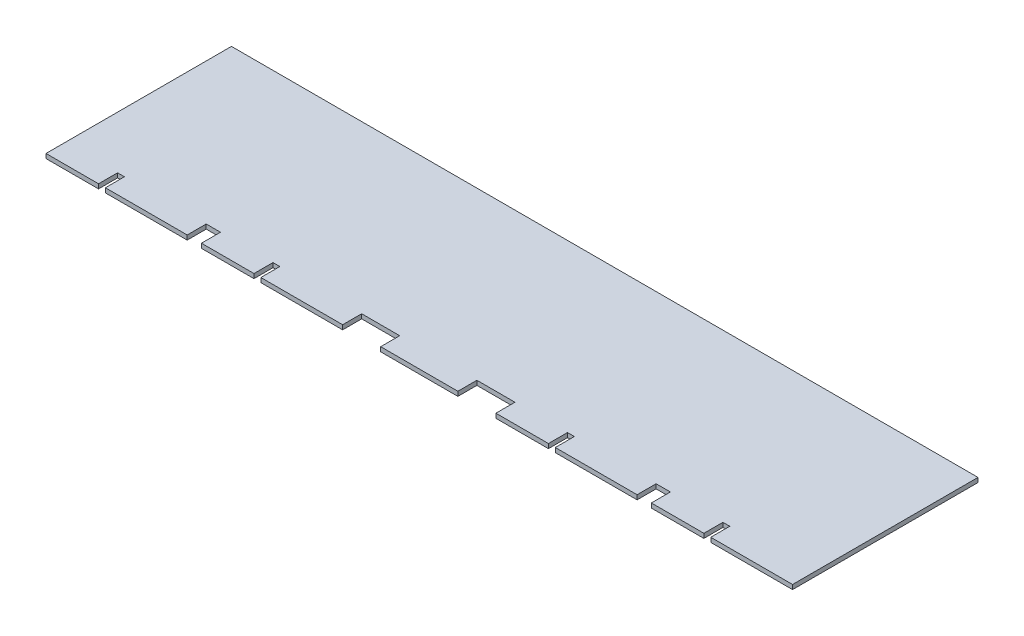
ISO-10303-21;
HEADER;
FILE_DESCRIPTION(('STEP AP214'),'2;1');
FILE_NAME('part.step','',(''),(''),'','','');
FILE_SCHEMA(('AUTOMOTIVE_DESIGN { 1 0 10303 214 1 1 1 1 }'));
ENDSEC;
DATA;
#1=APPLICATION_CONTEXT('core data for automotive mechanical design processes');
#2=APPLICATION_PROTOCOL_DEFINITION('international standard','automotive_design',2000,#1);
#3=PRODUCT_CONTEXT('',#1,'mechanical');
#4=PRODUCT('Part','Part','',(#3));
#5=PRODUCT_RELATED_PRODUCT_CATEGORY('part','',(#4));
#6=PRODUCT_DEFINITION_FORMATION('','',#4);
#7=PRODUCT_DEFINITION_CONTEXT('part definition',#1,'design');
#8=PRODUCT_DEFINITION('design','',#6,#7);
#9=PRODUCT_DEFINITION_SHAPE('','',#8);
#10=(LENGTH_UNIT() NAMED_UNIT(*) SI_UNIT(.MILLI.,.METRE.));
#11=(NAMED_UNIT(*) PLANE_ANGLE_UNIT() SI_UNIT($,.RADIAN.));
#12=(NAMED_UNIT(*) SI_UNIT($,.STERADIAN.) SOLID_ANGLE_UNIT());
#13=UNCERTAINTY_MEASURE_WITH_UNIT(LENGTH_MEASURE(1.E-05),#10,'distance_accuracy_value','');
#14=(GEOMETRIC_REPRESENTATION_CONTEXT(3) GLOBAL_UNCERTAINTY_ASSIGNED_CONTEXT((#13)) GLOBAL_UNIT_ASSIGNED_CONTEXT((#10,
#11,#12)) REPRESENTATION_CONTEXT('',''));
#15=CARTESIAN_POINT('',(0.,0.,0.));
#16=DIRECTION('',(0.,0.,1.));
#17=DIRECTION('',(1.,0.,0.));
#18=AXIS2_PLACEMENT_3D('',#15,#16,#17);
#19=CARTESIAN_POINT('',(-207.884528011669,0.775,0.));
#20=DIRECTION('',(0.,0.,-1.));
#21=DIRECTION('',(-1.,0.,0.));
#22=AXIS2_PLACEMENT_3D('',#19,#20,#21);
#23=PLANE('',#22);
#24=DIRECTION('',(1.,0.,0.));
#25=VECTOR('',#24,1.);
#26=CARTESIAN_POINT('',(-207.884528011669,-0.775,0.));
#27=LINE('',#26,#25);
#28=CARTESIAN_POINT('',(-13.3985,-0.775,0.));
#29=VERTEX_POINT('',#28);
#30=CARTESIAN_POINT('',(13.3985,-0.775,0.));
#31=VERTEX_POINT('',#30);
#32=EDGE_CURVE('E297',#29,#31,#27,.T.);
#33=ORIENTED_EDGE('',*,*,#32,.T.);
#34=DIRECTION('',(0.,-1.,0.));
#35=VECTOR('',#34,1.);
#36=CARTESIAN_POINT('',(13.3985,0.775,0.));
#37=LINE('',#36,#35);
#38=CARTESIAN_POINT('',(13.3985,0.775,0.));
#39=VERTEX_POINT('',#38);
#40=EDGE_CURVE('E11',#39,#31,#37,.T.);
#41=ORIENTED_EDGE('',*,*,#40,.F.);
#42=DIRECTION('',(1.,0.,0.));
#43=VECTOR('',#42,1.);
#44=CARTESIAN_POINT('',(-207.884528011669,0.775,0.));
#45=LINE('',#44,#43);
#46=CARTESIAN_POINT('',(-13.3985,0.775,0.));
#47=VERTEX_POINT('',#46);
#48=EDGE_CURVE('E380',#47,#39,#45,.T.);
#49=ORIENTED_EDGE('',*,*,#48,.F.);
#50=DIRECTION('',(0.,-1.,0.));
#51=VECTOR('',#50,1.);
#52=CARTESIAN_POINT('',(-13.3985,0.775,0.));
#53=LINE('',#52,#51);
#54=EDGE_CURVE('E47',#47,#29,#53,.T.);
#55=ORIENTED_EDGE('',*,*,#54,.T.);
#56=EDGE_LOOP('',(#33,#41,#49,#55));
#57=FACE_BOUND('',#56,.T.);
#58=ADVANCED_FACE('F30',(#57),#23,.F.);
#59=CARTESIAN_POINT('',(13.3985,0.775,-32.1945));
#60=DIRECTION('',(-1.,0.,0.));
#61=DIRECTION('',(0.,0.,1.));
#62=AXIS2_PLACEMENT_3D('',#59,#60,#61);
#63=PLANE('',#62);
#64=DIRECTION('',(0.,0.,-1.));
#65=VECTOR('',#64,1.);
#66=CARTESIAN_POINT('',(13.3985,-0.775,-32.1945));
#67=LINE('',#66,#65);
#68=CARTESIAN_POINT('',(13.3985,-0.775,-6.604));
#69=VERTEX_POINT('',#68);
#70=EDGE_CURVE('E299',#31,#69,#67,.T.);
#71=ORIENTED_EDGE('',*,*,#70,.T.);
#72=DIRECTION('',(0.,-1.,0.));
#73=VECTOR('',#72,1.);
#74=CARTESIAN_POINT('',(13.3985,0.775,-6.604));
#75=LINE('',#74,#73);
#76=CARTESIAN_POINT('',(13.3985,0.775,-6.604));
#77=VERTEX_POINT('',#76);
#78=EDGE_CURVE('E39',#77,#69,#75,.T.);
#79=ORIENTED_EDGE('',*,*,#78,.F.);
#80=DIRECTION('',(0.,0.,-1.));
#81=VECTOR('',#80,1.);
#82=CARTESIAN_POINT('',(13.3985,0.775,-32.1945));
#83=LINE('',#82,#81);
#84=EDGE_CURVE('E170',#39,#77,#83,.T.);
#85=ORIENTED_EDGE('',*,*,#84,.F.);
#86=ORIENTED_EDGE('',*,*,#40,.T.);
#87=EDGE_LOOP('',(#71,#79,#85,#86));
#88=FACE_BOUND('',#87,.T.);
#89=ADVANCED_FACE('F32',(#88),#63,.F.);
#90=CARTESIAN_POINT('',(-207.884528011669,0.775,-6.604));
#91=DIRECTION('',(0.,0.,-1.));
#92=DIRECTION('',(-1.,0.,0.));
#93=AXIS2_PLACEMENT_3D('',#90,#91,#92);
#94=PLANE('',#93);
#95=DIRECTION('',(1.,0.,0.));
#96=VECTOR('',#95,1.);
#97=CARTESIAN_POINT('',(-207.884528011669,-0.775,-6.604));
#98=LINE('',#97,#96);
#99=CARTESIAN_POINT('',(26.6065,-0.775,-6.604));
#100=VERTEX_POINT('',#99);
#101=EDGE_CURVE('E303',#69,#100,#98,.T.);
#102=ORIENTED_EDGE('',*,*,#101,.T.);
#103=DIRECTION('',(0.,-1.,0.));
#104=VECTOR('',#103,1.);
#105=CARTESIAN_POINT('',(26.6065,0.775,-6.604));
#106=LINE('',#105,#104);
#107=CARTESIAN_POINT('',(26.6065,0.775,-6.604));
#108=VERTEX_POINT('',#107);
#109=EDGE_CURVE('E454',#108,#100,#106,.T.);
#110=ORIENTED_EDGE('',*,*,#109,.F.);
#111=DIRECTION('',(1.,0.,0.));
#112=VECTOR('',#111,1.);
#113=CARTESIAN_POINT('',(-207.884528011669,0.775,-6.604));
#114=LINE('',#113,#112);
#115=EDGE_CURVE('E461',#77,#108,#114,.T.);
#116=ORIENTED_EDGE('',*,*,#115,.F.);
#117=ORIENTED_EDGE('',*,*,#78,.T.);
#118=EDGE_LOOP('',(#102,#110,#116,#117));
#119=FACE_BOUND('',#118,.T.);
#120=ADVANCED_FACE('F459',(#119),#94,.F.);
#121=CARTESIAN_POINT('',(26.6065,0.775,-32.1945));
#122=DIRECTION('',(-1.,0.,0.));
#123=DIRECTION('',(0.,0.,1.));
#124=AXIS2_PLACEMENT_3D('',#121,#122,#123);
#125=PLANE('',#124);
#126=DIRECTION('',(0.,0.,-1.));
#127=VECTOR('',#126,1.);
#128=CARTESIAN_POINT('',(26.6065,-0.775,-32.1945));
#129=LINE('',#128,#127);
#130=CARTESIAN_POINT('',(26.6065,-0.775,0.));
#131=VERTEX_POINT('',#130);
#132=EDGE_CURVE('E306',#131,#100,#129,.T.);
#133=ORIENTED_EDGE('',*,*,#132,.F.);
#134=DIRECTION('',(0.,-1.,0.));
#135=VECTOR('',#134,1.);
#136=CARTESIAN_POINT('',(26.6065,0.775,0.));
#137=LINE('',#136,#135);
#138=CARTESIAN_POINT('',(26.6065,0.775,0.));
#139=VERTEX_POINT('',#138);
#140=EDGE_CURVE('E452',#139,#131,#137,.T.);
#141=ORIENTED_EDGE('',*,*,#140,.F.);
#142=DIRECTION('',(0.,0.,-1.));
#143=VECTOR('',#142,1.);
#144=CARTESIAN_POINT('',(26.6065,0.775,-32.1945));
#145=LINE('',#144,#143);
#146=EDGE_CURVE('E472',#139,#108,#145,.T.);
#147=ORIENTED_EDGE('',*,*,#146,.T.);
#148=ORIENTED_EDGE('',*,*,#109,.T.);
#149=EDGE_LOOP('',(#133,#141,#147,#148));
#150=FACE_BOUND('',#149,.T.);
#151=ADVANCED_FACE('F468',(#150),#125,.T.);
#152=CARTESIAN_POINT('',(-207.884528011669,0.775,0.));
#153=DIRECTION('',(0.,0.,-1.));
#154=DIRECTION('',(-1.,0.,0.));
#155=AXIS2_PLACEMENT_3D('',#152,#153,#154);
#156=PLANE('',#155);
#157=DIRECTION('',(1.,0.,0.));
#158=VECTOR('',#157,1.);
#159=CARTESIAN_POINT('',(-207.884528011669,-0.775,0.));
#160=LINE('',#159,#158);
#161=CARTESIAN_POINT('',(44.8437,-0.775,0.));
#162=VERTEX_POINT('',#161);
#163=EDGE_CURVE('E309',#131,#162,#160,.T.);
#164=ORIENTED_EDGE('',*,*,#163,.T.);
#165=DIRECTION('',(0.,-1.,0.));
#166=VECTOR('',#165,1.);
#167=CARTESIAN_POINT('',(44.8437,0.775,0.));
#168=LINE('',#167,#166);
#169=CARTESIAN_POINT('',(44.8437,0.775,0.));
#170=VERTEX_POINT('',#169);
#171=EDGE_CURVE('E449',#170,#162,#168,.T.);
#172=ORIENTED_EDGE('',*,*,#171,.F.);
#173=DIRECTION('',(1.,0.,0.));
#174=VECTOR('',#173,1.);
#175=CARTESIAN_POINT('',(-207.884528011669,0.775,0.));
#176=LINE('',#175,#174);
#177=EDGE_CURVE('E473',#139,#170,#176,.T.);
#178=ORIENTED_EDGE('',*,*,#177,.F.);
#179=ORIENTED_EDGE('',*,*,#140,.T.);
#180=EDGE_LOOP('',(#164,#172,#178,#179));
#181=FACE_BOUND('',#180,.T.);
#182=ADVANCED_FACE('F782',(#181),#156,.F.);
#183=CARTESIAN_POINT('',(44.8437,0.775,-32.1945));
#184=DIRECTION('',(-1.,0.,0.));
#185=DIRECTION('',(0.,0.,1.));
#186=AXIS2_PLACEMENT_3D('',#183,#184,#185);
#187=PLANE('',#186);
#188=DIRECTION('',(0.,0.,-1.));
#189=VECTOR('',#188,1.);
#190=CARTESIAN_POINT('',(44.8437,-0.775,-32.1945));
#191=LINE('',#190,#189);
#192=CARTESIAN_POINT('',(44.8437,-0.775,-6.604));
#193=VERTEX_POINT('',#192);
#194=EDGE_CURVE('E311',#162,#193,#191,.T.);
#195=ORIENTED_EDGE('',*,*,#194,.T.);
#196=DIRECTION('',(0.,-1.,0.));
#197=VECTOR('',#196,1.);
#198=CARTESIAN_POINT('',(44.8437,0.775,-6.604));
#199=LINE('',#198,#197);
#200=CARTESIAN_POINT('',(44.8437,0.775,-6.604));
#201=VERTEX_POINT('',#200);
#202=EDGE_CURVE('E446',#201,#193,#199,.T.);
#203=ORIENTED_EDGE('',*,*,#202,.F.);
#204=DIRECTION('',(0.,0.,-1.));
#205=VECTOR('',#204,1.);
#206=CARTESIAN_POINT('',(44.8437,0.775,-32.1945));
#207=LINE('',#206,#205);
#208=EDGE_CURVE('E475',#170,#201,#207,.T.);
#209=ORIENTED_EDGE('',*,*,#208,.F.);
#210=ORIENTED_EDGE('',*,*,#171,.T.);
#211=EDGE_LOOP('',(#195,#203,#209,#210));
#212=FACE_BOUND('',#211,.T.);
#213=ADVANCED_FACE('F868',(#212),#187,.F.);
#214=CARTESIAN_POINT('',(-207.884528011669,0.775,-6.604));
#215=DIRECTION('',(0.,0.,-1.));
#216=DIRECTION('',(-1.,0.,0.));
#217=AXIS2_PLACEMENT_3D('',#214,#215,#216);
#218=PLANE('',#217);
#219=DIRECTION('',(1.,0.,0.));
#220=VECTOR('',#219,1.);
#221=CARTESIAN_POINT('',(-207.884528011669,-0.775,-6.604));
#222=LINE('',#221,#220);
#223=CARTESIAN_POINT('',(47.2313,-0.775,-6.604));
#224=VERTEX_POINT('',#223);
#225=EDGE_CURVE('E315',#193,#224,#222,.T.);
#226=ORIENTED_EDGE('',*,*,#225,.T.);
#227=DIRECTION('',(0.,-1.,0.));
#228=VECTOR('',#227,1.);
#229=CARTESIAN_POINT('',(47.2313,0.775,-6.604));
#230=LINE('',#229,#228);
#231=CARTESIAN_POINT('',(47.2313,0.775,-6.604));
#232=VERTEX_POINT('',#231);
#233=EDGE_CURVE('E444',#232,#224,#230,.T.);
#234=ORIENTED_EDGE('',*,*,#233,.F.);
#235=DIRECTION('',(1.,0.,0.));
#236=VECTOR('',#235,1.);
#237=CARTESIAN_POINT('',(-207.884528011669,0.775,-6.604));
#238=LINE('',#237,#236);
#239=EDGE_CURVE('E483',#201,#232,#238,.T.);
#240=ORIENTED_EDGE('',*,*,#239,.F.);
#241=ORIENTED_EDGE('',*,*,#202,.T.);
#242=EDGE_LOOP('',(#226,#234,#240,#241));
#243=FACE_BOUND('',#242,.T.);
#244=ADVANCED_FACE('F859',(#243),#218,.F.);
#245=CARTESIAN_POINT('',(47.2313,0.775,-32.1945));
#246=DIRECTION('',(-1.,0.,0.));
#247=DIRECTION('',(0.,0.,1.));
#248=AXIS2_PLACEMENT_3D('',#245,#246,#247);
#249=PLANE('',#248);
#250=DIRECTION('',(0.,0.,-1.));
#251=VECTOR('',#250,1.);
#252=CARTESIAN_POINT('',(47.2313,-0.775,-32.1945));
#253=LINE('',#252,#251);
#254=CARTESIAN_POINT('',(47.2313,-0.775,0.));
#255=VERTEX_POINT('',#254);
#256=EDGE_CURVE('E318',#255,#224,#253,.T.);
#257=ORIENTED_EDGE('',*,*,#256,.F.);
#258=DIRECTION('',(0.,-1.,0.));
#259=VECTOR('',#258,1.);
#260=CARTESIAN_POINT('',(47.2313,0.775,0.));
#261=LINE('',#260,#259);
#262=CARTESIAN_POINT('',(47.2313,0.775,0.));
#263=VERTEX_POINT('',#262);
#264=EDGE_CURVE('E442',#263,#255,#261,.T.);
#265=ORIENTED_EDGE('',*,*,#264,.F.);
#266=DIRECTION('',(0.,0.,-1.));
#267=VECTOR('',#266,1.);
#268=CARTESIAN_POINT('',(47.2313,0.775,-32.1945));
#269=LINE('',#268,#267);
#270=EDGE_CURVE('E485',#263,#232,#269,.T.);
#271=ORIENTED_EDGE('',*,*,#270,.T.);
#272=ORIENTED_EDGE('',*,*,#233,.T.);
#273=EDGE_LOOP('',(#257,#265,#271,#272));
#274=FACE_BOUND('',#273,.T.);
#275=ADVANCED_FACE('F851',(#274),#249,.T.);
#276=CARTESIAN_POINT('',(75.6285,-0.775,0.));
#277=VERTEX_POINT('',#276);
#278=EDGE_CURVE('E313',#255,#277,#160,.T.);
#279=ORIENTED_EDGE('',*,*,#278,.T.);
#280=DIRECTION('',(0.,-1.,0.));
#281=VECTOR('',#280,1.);
#282=CARTESIAN_POINT('',(75.6285,0.775,0.));
#283=LINE('',#282,#281);
#284=CARTESIAN_POINT('',(75.6285,0.775,0.));
#285=VERTEX_POINT('',#284);
#286=EDGE_CURVE('E439',#285,#277,#283,.T.);
#287=ORIENTED_EDGE('',*,*,#286,.F.);
#288=EDGE_CURVE('E478',#263,#285,#176,.T.);
#289=ORIENTED_EDGE('',*,*,#288,.F.);
#290=ORIENTED_EDGE('',*,*,#264,.T.);
#291=EDGE_LOOP('',(#279,#287,#289,#290));
#292=FACE_BOUND('',#291,.T.);
#293=ADVANCED_FACE('F818',(#292),#156,.F.);
#294=CARTESIAN_POINT('',(75.6285,0.775,-32.1945));
#295=DIRECTION('',(-1.,0.,0.));
#296=DIRECTION('',(0.,0.,1.));
#297=AXIS2_PLACEMENT_3D('',#294,#295,#296);
#298=PLANE('',#297);
#299=DIRECTION('',(0.,0.,-1.));
#300=VECTOR('',#299,1.);
#301=CARTESIAN_POINT('',(75.6285,-0.775,-32.1945));
#302=LINE('',#301,#300);
#303=CARTESIAN_POINT('',(75.6285,-0.775,-6.604));
#304=VERTEX_POINT('',#303);
#305=EDGE_CURVE('E321',#277,#304,#302,.T.);
#306=ORIENTED_EDGE('',*,*,#305,.T.);
#307=DIRECTION('',(0.,-1.,0.));
#308=VECTOR('',#307,1.);
#309=CARTESIAN_POINT('',(75.6285,0.775,-6.604));
#310=LINE('',#309,#308);
#311=CARTESIAN_POINT('',(75.6285,0.775,-6.604));
#312=VERTEX_POINT('',#311);
#313=EDGE_CURVE('E436',#312,#304,#310,.T.);
#314=ORIENTED_EDGE('',*,*,#313,.F.);
#315=DIRECTION('',(0.,0.,-1.));
#316=VECTOR('',#315,1.);
#317=CARTESIAN_POINT('',(75.6285,0.775,-32.1945));
#318=LINE('',#317,#316);
#319=EDGE_CURVE('E488',#285,#312,#318,.T.);
#320=ORIENTED_EDGE('',*,*,#319,.F.);
#321=ORIENTED_EDGE('',*,*,#286,.T.);
#322=EDGE_LOOP('',(#306,#314,#320,#321));
#323=FACE_BOUND('',#322,.T.);
#324=ADVANCED_FACE('F834',(#323),#298,.F.);
#325=CARTESIAN_POINT('',(-207.884528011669,0.775,-6.604));
#326=DIRECTION('',(0.,0.,-1.));
#327=DIRECTION('',(-1.,0.,0.));
#328=AXIS2_PLACEMENT_3D('',#325,#326,#327);
#329=PLANE('',#328);
#330=DIRECTION('',(1.,0.,0.));
#331=VECTOR('',#330,1.);
#332=CARTESIAN_POINT('',(-207.884528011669,-0.775,-6.604));
#333=LINE('',#332,#331);
#334=CARTESIAN_POINT('',(80.5815000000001,-0.775,-6.604));
#335=VERTEX_POINT('',#334);
#336=EDGE_CURVE('E323',#304,#335,#333,.T.);
#337=ORIENTED_EDGE('',*,*,#336,.T.);
#338=DIRECTION('',(0.,-1.,0.));
#339=VECTOR('',#338,1.);
#340=CARTESIAN_POINT('',(80.5815000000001,0.775,-6.604));
#341=LINE('',#340,#339);
#342=CARTESIAN_POINT('',(80.5815000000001,0.775,-6.604));
#343=VERTEX_POINT('',#342);
#344=EDGE_CURVE('E434',#343,#335,#341,.T.);
#345=ORIENTED_EDGE('',*,*,#344,.F.);
#346=DIRECTION('',(1.,0.,0.));
#347=VECTOR('',#346,1.);
#348=CARTESIAN_POINT('',(-207.884528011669,0.775,-6.604));
#349=LINE('',#348,#347);
#350=EDGE_CURVE('E490',#312,#343,#349,.T.);
#351=ORIENTED_EDGE('',*,*,#350,.F.);
#352=ORIENTED_EDGE('',*,*,#313,.T.);
#353=EDGE_LOOP('',(#337,#345,#351,#352));
#354=FACE_BOUND('',#353,.T.);
#355=ADVANCED_FACE('F825',(#354),#329,.F.);
#356=CARTESIAN_POINT('',(80.5815,0.775,-32.1945));
#357=DIRECTION('',(-1.,0.,0.));
#358=DIRECTION('',(0.,0.,1.));
#359=AXIS2_PLACEMENT_3D('',#356,#357,#358);
#360=PLANE('',#359);
#361=DIRECTION('',(0.,0.,-1.));
#362=VECTOR('',#361,1.);
#363=CARTESIAN_POINT('',(80.5815,-0.775,-32.1945));
#364=LINE('',#363,#362);
#365=CARTESIAN_POINT('',(80.5815000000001,-0.775,0.));
#366=VERTEX_POINT('',#365);
#367=EDGE_CURVE('E326',#366,#335,#364,.T.);
#368=ORIENTED_EDGE('',*,*,#367,.F.);
#369=DIRECTION('',(0.,-1.,0.));
#370=VECTOR('',#369,1.);
#371=CARTESIAN_POINT('',(80.5815000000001,0.775,0.));
#372=LINE('',#371,#370);
#373=CARTESIAN_POINT('',(80.5815000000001,0.775,0.));
#374=VERTEX_POINT('',#373);
#375=EDGE_CURVE('E432',#374,#366,#372,.T.);
#376=ORIENTED_EDGE('',*,*,#375,.F.);
#377=DIRECTION('',(0.,0.,-1.));
#378=VECTOR('',#377,1.);
#379=CARTESIAN_POINT('',(80.5815,0.775,-32.1945));
#380=LINE('',#379,#378);
#381=EDGE_CURVE('E492',#374,#343,#380,.T.);
#382=ORIENTED_EDGE('',*,*,#381,.T.);
#383=ORIENTED_EDGE('',*,*,#344,.T.);
#384=EDGE_LOOP('',(#368,#376,#382,#383));
#385=FACE_BOUND('',#384,.T.);
#386=ADVANCED_FACE('F816',(#385),#360,.T.);
#387=CARTESIAN_POINT('',(98.8187,-0.775,0.));
#388=VERTEX_POINT('',#387);
#389=EDGE_CURVE('E329',#366,#388,#160,.T.);
#390=ORIENTED_EDGE('',*,*,#389,.T.);
#391=DIRECTION('',(0.,-1.,0.));
#392=VECTOR('',#391,1.);
#393=CARTESIAN_POINT('',(98.8187,0.775,0.));
#394=LINE('',#393,#392);
#395=CARTESIAN_POINT('',(98.8187,0.775,0.));
#396=VERTEX_POINT('',#395);
#397=EDGE_CURVE('E429',#396,#388,#394,.T.);
#398=ORIENTED_EDGE('',*,*,#397,.F.);
#399=EDGE_CURVE('E495',#374,#396,#176,.T.);
#400=ORIENTED_EDGE('',*,*,#399,.F.);
#401=ORIENTED_EDGE('',*,*,#375,.T.);
#402=EDGE_LOOP('',(#390,#398,#400,#401));
#403=FACE_BOUND('',#402,.T.);
#404=ADVANCED_FACE('F783',(#403),#156,.F.);
#405=CARTESIAN_POINT('',(98.8187,0.775,-32.1945));
#406=DIRECTION('',(-1.,0.,0.));
#407=DIRECTION('',(0.,0.,1.));
#408=AXIS2_PLACEMENT_3D('',#405,#406,#407);
#409=PLANE('',#408);
#410=DIRECTION('',(0.,0.,-1.));
#411=VECTOR('',#410,1.);
#412=CARTESIAN_POINT('',(98.8187,-0.775,-32.1945));
#413=LINE('',#412,#411);
#414=CARTESIAN_POINT('',(98.8187,-0.775,-6.604));
#415=VERTEX_POINT('',#414);
#416=EDGE_CURVE('E330',#388,#415,#413,.T.);
#417=ORIENTED_EDGE('',*,*,#416,.T.);
#418=DIRECTION('',(0.,-1.,0.));
#419=VECTOR('',#418,1.);
#420=CARTESIAN_POINT('',(98.8187,0.775,-6.604));
#421=LINE('',#420,#419);
#422=CARTESIAN_POINT('',(98.8187,0.775,-6.604));
#423=VERTEX_POINT('',#422);
#424=EDGE_CURVE('E426',#423,#415,#421,.T.);
#425=ORIENTED_EDGE('',*,*,#424,.F.);
#426=DIRECTION('',(0.,0.,-1.));
#427=VECTOR('',#426,1.);
#428=CARTESIAN_POINT('',(98.8187,0.775,-32.1945));
#429=LINE('',#428,#427);
#430=EDGE_CURVE('E496',#396,#423,#429,.T.);
#431=ORIENTED_EDGE('',*,*,#430,.F.);
#432=ORIENTED_EDGE('',*,*,#397,.T.);
#433=EDGE_LOOP('',(#417,#425,#431,#432));
#434=FACE_BOUND('',#433,.T.);
#435=ADVANCED_FACE('F799',(#434),#409,.F.);
#436=CARTESIAN_POINT('',(-207.884528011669,0.775,-6.604));
#437=DIRECTION('',(0.,0.,-1.));
#438=DIRECTION('',(-1.,0.,0.));
#439=AXIS2_PLACEMENT_3D('',#436,#437,#438);
#440=PLANE('',#439);
#441=DIRECTION('',(1.,0.,0.));
#442=VECTOR('',#441,1.);
#443=CARTESIAN_POINT('',(-207.884528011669,-0.775,-6.604));
#444=LINE('',#443,#442);
#445=CARTESIAN_POINT('',(101.2063,-0.775,-6.604));
#446=VERTEX_POINT('',#445);
#447=EDGE_CURVE('E332',#415,#446,#444,.T.);
#448=ORIENTED_EDGE('',*,*,#447,.T.);
#449=DIRECTION('',(0.,-1.,0.));
#450=VECTOR('',#449,1.);
#451=CARTESIAN_POINT('',(101.2063,0.775,-6.604));
#452=LINE('',#451,#450);
#453=CARTESIAN_POINT('',(101.2063,0.775,-6.604));
#454=VERTEX_POINT('',#453);
#455=EDGE_CURVE('E424',#454,#446,#452,.T.);
#456=ORIENTED_EDGE('',*,*,#455,.F.);
#457=DIRECTION('',(1.,0.,0.));
#458=VECTOR('',#457,1.);
#459=CARTESIAN_POINT('',(-207.884528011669,0.775,-6.604));
#460=LINE('',#459,#458);
#461=EDGE_CURVE('E498',#423,#454,#460,.T.);
#462=ORIENTED_EDGE('',*,*,#461,.F.);
#463=ORIENTED_EDGE('',*,*,#424,.T.);
#464=EDGE_LOOP('',(#448,#456,#462,#463));
#465=FACE_BOUND('',#464,.T.);
#466=ADVANCED_FACE('F790',(#465),#440,.F.);
#467=CARTESIAN_POINT('',(101.2063,0.775,-32.1945));
#468=DIRECTION('',(-1.,0.,0.));
#469=DIRECTION('',(0.,0.,1.));
#470=AXIS2_PLACEMENT_3D('',#467,#468,#469);
#471=PLANE('',#470);
#472=DIRECTION('',(0.,0.,-1.));
#473=VECTOR('',#472,1.);
#474=CARTESIAN_POINT('',(101.2063,-0.775,-32.1945));
#475=LINE('',#474,#473);
#476=CARTESIAN_POINT('',(101.2063,-0.775,0.));
#477=VERTEX_POINT('',#476);
#478=EDGE_CURVE('E335',#477,#446,#475,.T.);
#479=ORIENTED_EDGE('',*,*,#478,.F.);
#480=DIRECTION('',(0.,-1.,0.));
#481=VECTOR('',#480,1.);
#482=CARTESIAN_POINT('',(101.2063,0.775,0.));
#483=LINE('',#482,#481);
#484=CARTESIAN_POINT('',(101.2063,0.775,0.));
#485=VERTEX_POINT('',#484);
#486=EDGE_CURVE('E422',#485,#477,#483,.T.);
#487=ORIENTED_EDGE('',*,*,#486,.F.);
#488=DIRECTION('',(0.,0.,-1.));
#489=VECTOR('',#488,1.);
#490=CARTESIAN_POINT('',(101.2063,0.775,-32.1945));
#491=LINE('',#490,#489);
#492=EDGE_CURVE('E500',#485,#454,#491,.T.);
#493=ORIENTED_EDGE('',*,*,#492,.T.);
#494=ORIENTED_EDGE('',*,*,#455,.T.);
#495=EDGE_LOOP('',(#479,#487,#493,#494));
#496=FACE_BOUND('',#495,.T.);
#497=ADVANCED_FACE('F779',(#496),#471,.T.);
#498=CARTESIAN_POINT('',(129.6035,-0.775,0.));
#499=VERTEX_POINT('',#498);
#500=EDGE_CURVE('E312',#477,#499,#160,.T.);
#501=ORIENTED_EDGE('',*,*,#500,.T.);
#502=DIRECTION('',(0.,-1.,0.));
#503=VECTOR('',#502,1.);
#504=CARTESIAN_POINT('',(129.6035,0.775,0.));
#505=LINE('',#504,#503);
#506=CARTESIAN_POINT('',(129.6035,0.775,0.));
#507=VERTEX_POINT('',#506);
#508=EDGE_CURVE('E419',#507,#499,#505,.T.);
#509=ORIENTED_EDGE('',*,*,#508,.F.);
#510=EDGE_CURVE('E477',#485,#507,#176,.T.);
#511=ORIENTED_EDGE('',*,*,#510,.F.);
#512=ORIENTED_EDGE('',*,*,#486,.T.);
#513=EDGE_LOOP('',(#501,#509,#511,#512));
#514=FACE_BOUND('',#513,.T.);
#515=ADVANCED_FACE('F770',(#514),#156,.F.);
#516=CARTESIAN_POINT('',(129.6035,0.775,-32.1945));
#517=DIRECTION('',(-1.,0.,0.));
#518=DIRECTION('',(0.,0.,1.));
#519=AXIS2_PLACEMENT_3D('',#516,#517,#518);
#520=PLANE('',#519);
#521=DIRECTION('',(0.,0.,-1.));
#522=VECTOR('',#521,1.);
#523=CARTESIAN_POINT('',(129.6035,-0.775,-32.1945));
#524=LINE('',#523,#522);
#525=CARTESIAN_POINT('',(129.6035,-0.775,-64.389));
#526=VERTEX_POINT('',#525);
#527=EDGE_CURVE('E338',#499,#526,#524,.T.);
#528=ORIENTED_EDGE('',*,*,#527,.T.);
#529=DIRECTION('',(0.,-1.,0.));
#530=VECTOR('',#529,1.);
#531=CARTESIAN_POINT('',(129.6035,0.775,-64.389));
#532=LINE('',#531,#530);
#533=CARTESIAN_POINT('',(129.6035,0.775,-64.389));
#534=VERTEX_POINT('',#533);
#535=EDGE_CURVE('E417',#534,#526,#532,.T.);
#536=ORIENTED_EDGE('',*,*,#535,.F.);
#537=DIRECTION('',(0.,0.,-1.));
#538=VECTOR('',#537,1.);
#539=CARTESIAN_POINT('',(129.6035,0.775,-32.1945));
#540=LINE('',#539,#538);
#541=EDGE_CURVE('E503',#507,#534,#540,.T.);
#542=ORIENTED_EDGE('',*,*,#541,.F.);
#543=ORIENTED_EDGE('',*,*,#508,.T.);
#544=EDGE_LOOP('',(#528,#536,#542,#543));
#545=FACE_BOUND('',#544,.T.);
#546=ADVANCED_FACE('F761',(#545),#520,.F.);
#547=CARTESIAN_POINT('',(-207.884528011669,0.775,-64.389));
#548=DIRECTION('',(0.,0.,-1.));
#549=DIRECTION('',(-1.,0.,0.));
#550=AXIS2_PLACEMENT_3D('',#547,#548,#549);
#551=PLANE('',#550);
#552=DIRECTION('',(1.,0.,0.));
#553=VECTOR('',#552,1.);
#554=CARTESIAN_POINT('',(-207.884528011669,-0.775,-64.389));
#555=LINE('',#554,#553);
#556=CARTESIAN_POINT('',(-129.6035,-0.775,-64.389));
#557=VERTEX_POINT('',#556);
#558=EDGE_CURVE('E341',#557,#526,#555,.T.);
#559=ORIENTED_EDGE('',*,*,#558,.F.);
#560=DIRECTION('',(0.,-1.,0.));
#561=VECTOR('',#560,1.);
#562=CARTESIAN_POINT('',(-129.6035,0.775,-64.389));
#563=LINE('',#562,#561);
#564=CARTESIAN_POINT('',(-129.6035,0.775,-64.389));
#565=VERTEX_POINT('',#564);
#566=EDGE_CURVE('E415',#565,#557,#563,.T.);
#567=ORIENTED_EDGE('',*,*,#566,.F.);
#568=DIRECTION('',(1.,0.,0.));
#569=VECTOR('',#568,1.);
#570=CARTESIAN_POINT('',(-207.884528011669,0.775,-64.389));
#571=LINE('',#570,#569);
#572=EDGE_CURVE('E505',#565,#534,#571,.T.);
#573=ORIENTED_EDGE('',*,*,#572,.T.);
#574=ORIENTED_EDGE('',*,*,#535,.T.);
#575=EDGE_LOOP('',(#559,#567,#573,#574));
#576=FACE_BOUND('',#575,.T.);
#577=ADVANCED_FACE('F752',(#576),#551,.T.);
#578=CARTESIAN_POINT('',(-129.6035,0.775,-32.1945));
#579=DIRECTION('',(-1.,0.,0.));
#580=DIRECTION('',(0.,0.,1.));
#581=AXIS2_PLACEMENT_3D('',#578,#579,#580);
#582=PLANE('',#581);
#583=DIRECTION('',(0.,0.,-1.));
#584=VECTOR('',#583,1.);
#585=CARTESIAN_POINT('',(-129.6035,-0.775,-32.1945));
#586=LINE('',#585,#584);
#587=CARTESIAN_POINT('',(-129.6035,-0.775,0.));
#588=VERTEX_POINT('',#587);
#589=EDGE_CURVE('E344',#588,#557,#586,.T.);
#590=ORIENTED_EDGE('',*,*,#589,.F.);
#591=DIRECTION('',(0.,-1.,0.));
#592=VECTOR('',#591,1.);
#593=CARTESIAN_POINT('',(-129.6035,0.775,0.));
#594=LINE('',#593,#592);
#595=CARTESIAN_POINT('',(-129.6035,0.775,0.));
#596=VERTEX_POINT('',#595);
#597=EDGE_CURVE('E413',#596,#588,#594,.T.);
#598=ORIENTED_EDGE('',*,*,#597,.F.);
#599=DIRECTION('',(0.,0.,-1.));
#600=VECTOR('',#599,1.);
#601=CARTESIAN_POINT('',(-129.6035,0.775,-32.1945));
#602=LINE('',#601,#600);
#603=EDGE_CURVE('E508',#596,#565,#602,.T.);
#604=ORIENTED_EDGE('',*,*,#603,.T.);
#605=ORIENTED_EDGE('',*,*,#566,.T.);
#606=EDGE_LOOP('',(#590,#598,#604,#605));
#607=FACE_BOUND('',#606,.T.);
#608=ADVANCED_FACE('F612',(#607),#582,.T.);
#609=CARTESIAN_POINT('',(-111.3663,-0.775,0.));
#610=VERTEX_POINT('',#609);
#611=EDGE_CURVE('E301',#588,#610,#27,.T.);
#612=ORIENTED_EDGE('',*,*,#611,.T.);
#613=DIRECTION('',(0.,-1.,0.));
#614=VECTOR('',#613,1.);
#615=CARTESIAN_POINT('',(-111.3663,0.775,0.));
#616=LINE('',#615,#614);
#617=CARTESIAN_POINT('',(-111.3663,0.775,0.));
#618=VERTEX_POINT('',#617);
#619=EDGE_CURVE('E410',#618,#610,#616,.T.);
#620=ORIENTED_EDGE('',*,*,#619,.F.);
#621=EDGE_CURVE('E511',#596,#618,#45,.T.);
#622=ORIENTED_EDGE('',*,*,#621,.F.);
#623=ORIENTED_EDGE('',*,*,#597,.T.);
#624=EDGE_LOOP('',(#612,#620,#622,#623));
#625=FACE_BOUND('',#624,.T.);
#626=ADVANCED_FACE('F580',(#625),#23,.F.);
#627=CARTESIAN_POINT('',(-111.3663,0.775,-32.1945));
#628=DIRECTION('',(-1.,0.,0.));
#629=DIRECTION('',(0.,0.,1.));
#630=AXIS2_PLACEMENT_3D('',#627,#628,#629);
#631=PLANE('',#630);
#632=DIRECTION('',(0.,0.,-1.));
#633=VECTOR('',#632,1.);
#634=CARTESIAN_POINT('',(-111.3663,-0.775,-32.1945));
#635=LINE('',#634,#633);
#636=CARTESIAN_POINT('',(-111.3663,-0.775,-6.604));
#637=VERTEX_POINT('',#636);
#638=EDGE_CURVE('E347',#610,#637,#635,.T.);
#639=ORIENTED_EDGE('',*,*,#638,.T.);
#640=DIRECTION('',(0.,-1.,0.));
#641=VECTOR('',#640,1.);
#642=CARTESIAN_POINT('',(-111.3663,0.775,-6.604));
#643=LINE('',#642,#641);
#644=CARTESIAN_POINT('',(-111.3663,0.775,-6.604));
#645=VERTEX_POINT('',#644);
#646=EDGE_CURVE('E407',#645,#637,#643,.T.);
#647=ORIENTED_EDGE('',*,*,#646,.F.);
#648=DIRECTION('',(0.,0.,-1.));
#649=VECTOR('',#648,1.);
#650=CARTESIAN_POINT('',(-111.3663,0.775,-32.1945));
#651=LINE('',#650,#649);
#652=EDGE_CURVE('E512',#618,#645,#651,.T.);
#653=ORIENTED_EDGE('',*,*,#652,.F.);
#654=ORIENTED_EDGE('',*,*,#619,.T.);
#655=EDGE_LOOP('',(#639,#647,#653,#654));
#656=FACE_BOUND('',#655,.T.);
#657=ADVANCED_FACE('F585',(#656),#631,.F.);
#658=CARTESIAN_POINT('',(-207.884528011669,0.775,-6.604));
#659=DIRECTION('',(0.,0.,-1.));
#660=DIRECTION('',(-1.,0.,0.));
#661=AXIS2_PLACEMENT_3D('',#658,#659,#660);
#662=PLANE('',#661);
#663=DIRECTION('',(1.,0.,0.));
#664=VECTOR('',#663,1.);
#665=CARTESIAN_POINT('',(-207.884528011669,-0.775,-6.604));
#666=LINE('',#665,#664);
#667=CARTESIAN_POINT('',(-108.9787,-0.775,-6.604));
#668=VERTEX_POINT('',#667);
#669=EDGE_CURVE('E349',#637,#668,#666,.T.);
#670=ORIENTED_EDGE('',*,*,#669,.T.);
#671=DIRECTION('',(0.,-1.,0.));
#672=VECTOR('',#671,1.);
#673=CARTESIAN_POINT('',(-108.9787,0.775,-6.604));
#674=LINE('',#673,#672);
#675=CARTESIAN_POINT('',(-108.9787,0.775,-6.604));
#676=VERTEX_POINT('',#675);
#677=EDGE_CURVE('E405',#676,#668,#674,.T.);
#678=ORIENTED_EDGE('',*,*,#677,.F.);
#679=DIRECTION('',(1.,0.,0.));
#680=VECTOR('',#679,1.);
#681=CARTESIAN_POINT('',(-207.884528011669,0.775,-6.604));
#682=LINE('',#681,#680);
#683=EDGE_CURVE('E514',#645,#676,#682,.T.);
#684=ORIENTED_EDGE('',*,*,#683,.F.);
#685=ORIENTED_EDGE('',*,*,#646,.T.);
#686=EDGE_LOOP('',(#670,#678,#684,#685));
#687=FACE_BOUND('',#686,.T.);
#688=ADVANCED_FACE('F591',(#687),#662,.F.);
#689=CARTESIAN_POINT('',(-108.9787,0.775,-32.1945));
#690=DIRECTION('',(-1.,0.,0.));
#691=DIRECTION('',(0.,0.,1.));
#692=AXIS2_PLACEMENT_3D('',#689,#690,#691);
#693=PLANE('',#692);
#694=DIRECTION('',(0.,0.,-1.));
#695=VECTOR('',#694,1.);
#696=CARTESIAN_POINT('',(-108.9787,-0.775,-32.1945));
#697=LINE('',#696,#695);
#698=CARTESIAN_POINT('',(-108.9787,-0.775,0.));
#699=VERTEX_POINT('',#698);
#700=EDGE_CURVE('E352',#699,#668,#697,.T.);
#701=ORIENTED_EDGE('',*,*,#700,.F.);
#702=DIRECTION('',(0.,-1.,0.));
#703=VECTOR('',#702,1.);
#704=CARTESIAN_POINT('',(-108.9787,0.775,0.));
#705=LINE('',#704,#703);
#706=CARTESIAN_POINT('',(-108.9787,0.775,0.));
#707=VERTEX_POINT('',#706);
#708=EDGE_CURVE('E403',#707,#699,#705,.T.);
#709=ORIENTED_EDGE('',*,*,#708,.F.);
#710=DIRECTION('',(0.,0.,-1.));
#711=VECTOR('',#710,1.);
#712=CARTESIAN_POINT('',(-108.9787,0.775,-32.1945));
#713=LINE('',#712,#711);
#714=EDGE_CURVE('E516',#707,#676,#713,.T.);
#715=ORIENTED_EDGE('',*,*,#714,.T.);
#716=ORIENTED_EDGE('',*,*,#677,.T.);
#717=EDGE_LOOP('',(#701,#709,#715,#716));
#718=FACE_BOUND('',#717,.T.);
#719=ADVANCED_FACE('F594',(#718),#693,.T.);
#720=CARTESIAN_POINT('',(-80.5815,-0.775,0.));
#721=VERTEX_POINT('',#720);
#722=EDGE_CURVE('E355',#699,#721,#27,.T.);
#723=ORIENTED_EDGE('',*,*,#722,.T.);
#724=DIRECTION('',(0.,-1.,0.));
#725=VECTOR('',#724,1.);
#726=CARTESIAN_POINT('',(-80.5815,0.775,0.));
#727=LINE('',#726,#725);
#728=CARTESIAN_POINT('',(-80.5815,0.775,0.));
#729=VERTEX_POINT('',#728);
#730=EDGE_CURVE('E400',#729,#721,#727,.T.);
#731=ORIENTED_EDGE('',*,*,#730,.F.);
#732=EDGE_CURVE('E519',#707,#729,#45,.T.);
#733=ORIENTED_EDGE('',*,*,#732,.F.);
#734=ORIENTED_EDGE('',*,*,#708,.T.);
#735=EDGE_LOOP('',(#723,#731,#733,#734));
#736=FACE_BOUND('',#735,.T.);
#737=ADVANCED_FACE('F547',(#736),#23,.F.);
#738=CARTESIAN_POINT('',(-80.5815,0.775,-32.1945));
#739=DIRECTION('',(-1.,0.,0.));
#740=DIRECTION('',(0.,0.,1.));
#741=AXIS2_PLACEMENT_3D('',#738,#739,#740);
#742=PLANE('',#741);
#743=DIRECTION('',(0.,0.,-1.));
#744=VECTOR('',#743,1.);
#745=CARTESIAN_POINT('',(-80.5815,-0.775,-32.1945));
#746=LINE('',#745,#744);
#747=CARTESIAN_POINT('',(-80.5815,-0.775,-6.604));
#748=VERTEX_POINT('',#747);
#749=EDGE_CURVE('E356',#721,#748,#746,.T.);
#750=ORIENTED_EDGE('',*,*,#749,.T.);
#751=DIRECTION('',(0.,-1.,0.));
#752=VECTOR('',#751,1.);
#753=CARTESIAN_POINT('',(-80.5815,0.775,-6.604));
#754=LINE('',#753,#752);
#755=CARTESIAN_POINT('',(-80.5815,0.775,-6.604));
#756=VERTEX_POINT('',#755);
#757=EDGE_CURVE('E398',#756,#748,#754,.T.);
#758=ORIENTED_EDGE('',*,*,#757,.F.);
#759=DIRECTION('',(0.,0.,-1.));
#760=VECTOR('',#759,1.);
#761=CARTESIAN_POINT('',(-80.5815,0.775,-32.1945));
#762=LINE('',#761,#760);
#763=EDGE_CURVE('E520',#729,#756,#762,.T.);
#764=ORIENTED_EDGE('',*,*,#763,.F.);
#765=ORIENTED_EDGE('',*,*,#730,.T.);
#766=EDGE_LOOP('',(#750,#758,#764,#765));
#767=FACE_BOUND('',#766,.T.);
#768=ADVANCED_FACE('F551',(#767),#742,.F.);
#769=CARTESIAN_POINT('',(-207.884528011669,0.775,-6.604));
#770=DIRECTION('',(0.,0.,1.));
#771=DIRECTION('',(1.,0.,0.));
#772=AXIS2_PLACEMENT_3D('',#769,#770,#771);
#773=PLANE('',#772);
#774=DIRECTION('',(-1.,0.,0.));
#775=VECTOR('',#774,1.);
#776=CARTESIAN_POINT('',(-207.884528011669,-0.775,-6.604));
#777=LINE('',#776,#775);
#778=CARTESIAN_POINT('',(-75.6285,-0.775,-6.604));
#779=VERTEX_POINT('',#778);
#780=EDGE_CURVE('E359',#779,#748,#777,.T.);
#781=ORIENTED_EDGE('',*,*,#780,.F.);
#782=DIRECTION('',(0.,-1.,0.));
#783=VECTOR('',#782,1.);
#784=CARTESIAN_POINT('',(-75.6285,0.775,-6.604));
#785=LINE('',#784,#783);
#786=CARTESIAN_POINT('',(-75.6285,0.775,-6.604));
#787=VERTEX_POINT('',#786);
#788=EDGE_CURVE('E396',#787,#779,#785,.T.);
#789=ORIENTED_EDGE('',*,*,#788,.F.);
#790=DIRECTION('',(-1.,0.,0.));
#791=VECTOR('',#790,1.);
#792=CARTESIAN_POINT('',(-207.884528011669,0.775,-6.604));
#793=LINE('',#792,#791);
#794=EDGE_CURVE('E522',#787,#756,#793,.T.);
#795=ORIENTED_EDGE('',*,*,#794,.T.);
#796=ORIENTED_EDGE('',*,*,#757,.T.);
#797=EDGE_LOOP('',(#781,#789,#795,#796));
#798=FACE_BOUND('',#797,.T.);
#799=ADVANCED_FACE('F554',(#798),#773,.T.);
#800=CARTESIAN_POINT('',(-75.6285,0.775,-32.1945));
#801=DIRECTION('',(-1.,0.,0.));
#802=DIRECTION('',(0.,0.,1.));
#803=AXIS2_PLACEMENT_3D('',#800,#801,#802);
#804=PLANE('',#803);
#805=DIRECTION('',(0.,0.,-1.));
#806=VECTOR('',#805,1.);
#807=CARTESIAN_POINT('',(-75.6285,-0.775,-32.1945));
#808=LINE('',#807,#806);
#809=CARTESIAN_POINT('',(-75.6285,-0.775,0.));
#810=VERTEX_POINT('',#809);
#811=EDGE_CURVE('E362',#810,#779,#808,.T.);
#812=ORIENTED_EDGE('',*,*,#811,.F.);
#813=DIRECTION('',(0.,-1.,0.));
#814=VECTOR('',#813,1.);
#815=CARTESIAN_POINT('',(-75.6285,0.775,0.));
#816=LINE('',#815,#814);
#817=CARTESIAN_POINT('',(-75.6285,0.775,0.));
#818=VERTEX_POINT('',#817);
#819=EDGE_CURVE('E394',#818,#810,#816,.T.);
#820=ORIENTED_EDGE('',*,*,#819,.F.);
#821=DIRECTION('',(0.,0.,-1.));
#822=VECTOR('',#821,1.);
#823=CARTESIAN_POINT('',(-75.6285,0.775,-32.1945));
#824=LINE('',#823,#822);
#825=EDGE_CURVE('E525',#818,#787,#824,.T.);
#826=ORIENTED_EDGE('',*,*,#825,.T.);
#827=ORIENTED_EDGE('',*,*,#788,.T.);
#828=EDGE_LOOP('',(#812,#820,#826,#827));
#829=FACE_BOUND('',#828,.T.);
#830=ADVANCED_FACE('F558',(#829),#804,.T.);
#831=CARTESIAN_POINT('',(-57.3913,-0.775,0.));
#832=VERTEX_POINT('',#831);
#833=EDGE_CURVE('E365',#810,#832,#27,.T.);
#834=ORIENTED_EDGE('',*,*,#833,.T.);
#835=DIRECTION('',(0.,-1.,0.));
#836=VECTOR('',#835,1.);
#837=CARTESIAN_POINT('',(-57.3913,0.775,0.));
#838=LINE('',#837,#836);
#839=CARTESIAN_POINT('',(-57.3913,0.775,0.));
#840=VERTEX_POINT('',#839);
#841=EDGE_CURVE('E391',#840,#832,#838,.T.);
#842=ORIENTED_EDGE('',*,*,#841,.F.);
#843=EDGE_CURVE('E528',#818,#840,#45,.T.);
#844=ORIENTED_EDGE('',*,*,#843,.F.);
#845=ORIENTED_EDGE('',*,*,#819,.T.);
#846=EDGE_LOOP('',(#834,#842,#844,#845));
#847=FACE_BOUND('',#846,.T.);
#848=ADVANCED_FACE('F563',(#847),#23,.F.);
#849=CARTESIAN_POINT('',(-57.3913,0.775,-32.1945));
#850=DIRECTION('',(-1.,0.,0.));
#851=DIRECTION('',(0.,0.,1.));
#852=AXIS2_PLACEMENT_3D('',#849,#850,#851);
#853=PLANE('',#852);
#854=DIRECTION('',(0.,0.,-1.));
#855=VECTOR('',#854,1.);
#856=CARTESIAN_POINT('',(-57.3913,-0.775,-32.1945));
#857=LINE('',#856,#855);
#858=CARTESIAN_POINT('',(-57.3913,-0.775,-6.604));
#859=VERTEX_POINT('',#858);
#860=EDGE_CURVE('E366',#832,#859,#857,.T.);
#861=ORIENTED_EDGE('',*,*,#860,.T.);
#862=DIRECTION('',(0.,-1.,0.));
#863=VECTOR('',#862,1.);
#864=CARTESIAN_POINT('',(-57.3913,0.775,-6.604));
#865=LINE('',#864,#863);
#866=CARTESIAN_POINT('',(-57.3913,0.775,-6.604));
#867=VERTEX_POINT('',#866);
#868=EDGE_CURVE('E388',#867,#859,#865,.T.);
#869=ORIENTED_EDGE('',*,*,#868,.F.);
#870=DIRECTION('',(0.,0.,-1.));
#871=VECTOR('',#870,1.);
#872=CARTESIAN_POINT('',(-57.3913,0.775,-32.1945));
#873=LINE('',#872,#871);
#874=EDGE_CURVE('E529',#840,#867,#873,.T.);
#875=ORIENTED_EDGE('',*,*,#874,.F.);
#876=ORIENTED_EDGE('',*,*,#841,.T.);
#877=EDGE_LOOP('',(#861,#869,#875,#876));
#878=FACE_BOUND('',#877,.T.);
#879=ADVANCED_FACE('F569',(#878),#853,.F.);
#880=CARTESIAN_POINT('',(-207.884528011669,0.775,-6.604));
#881=DIRECTION('',(0.,0.,-1.));
#882=DIRECTION('',(-1.,0.,0.));
#883=AXIS2_PLACEMENT_3D('',#880,#881,#882);
#884=PLANE('',#883);
#885=DIRECTION('',(1.,0.,0.));
#886=VECTOR('',#885,1.);
#887=CARTESIAN_POINT('',(-207.884528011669,-0.775,-6.604));
#888=LINE('',#887,#886);
#889=CARTESIAN_POINT('',(-55.0037,-0.775,-6.604));
#890=VERTEX_POINT('',#889);
#891=EDGE_CURVE('E368',#859,#890,#888,.T.);
#892=ORIENTED_EDGE('',*,*,#891,.T.);
#893=DIRECTION('',(0.,-1.,0.));
#894=VECTOR('',#893,1.);
#895=CARTESIAN_POINT('',(-55.0037,0.775,-6.604));
#896=LINE('',#895,#894);
#897=CARTESIAN_POINT('',(-55.0037,0.775,-6.604));
#898=VERTEX_POINT('',#897);
#899=EDGE_CURVE('E386',#898,#890,#896,.T.);
#900=ORIENTED_EDGE('',*,*,#899,.F.);
#901=DIRECTION('',(1.,0.,0.));
#902=VECTOR('',#901,1.);
#903=CARTESIAN_POINT('',(-207.884528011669,0.775,-6.604));
#904=LINE('',#903,#902);
#905=EDGE_CURVE('E531',#867,#898,#904,.T.);
#906=ORIENTED_EDGE('',*,*,#905,.F.);
#907=ORIENTED_EDGE('',*,*,#868,.T.);
#908=EDGE_LOOP('',(#892,#900,#906,#907));
#909=FACE_BOUND('',#908,.T.);
#910=ADVANCED_FACE('F573',(#909),#884,.F.);
#911=CARTESIAN_POINT('',(-55.0037,0.775,-32.1945));
#912=DIRECTION('',(-1.,0.,0.));
#913=DIRECTION('',(0.,0.,1.));
#914=AXIS2_PLACEMENT_3D('',#911,#912,#913);
#915=PLANE('',#914);
#916=DIRECTION('',(0.,0.,-1.));
#917=VECTOR('',#916,1.);
#918=CARTESIAN_POINT('',(-55.0037,-0.775,-32.1945));
#919=LINE('',#918,#917);
#920=CARTESIAN_POINT('',(-55.0037,-0.775,0.));
#921=VERTEX_POINT('',#920);
#922=EDGE_CURVE('E371',#921,#890,#919,.T.);
#923=ORIENTED_EDGE('',*,*,#922,.F.);
#924=DIRECTION('',(0.,-1.,0.));
#925=VECTOR('',#924,1.);
#926=CARTESIAN_POINT('',(-55.0037,0.775,0.));
#927=LINE('',#926,#925);
#928=CARTESIAN_POINT('',(-55.0037,0.775,0.));
#929=VERTEX_POINT('',#928);
#930=EDGE_CURVE('E384',#929,#921,#927,.T.);
#931=ORIENTED_EDGE('',*,*,#930,.F.);
#932=DIRECTION('',(0.,0.,-1.));
#933=VECTOR('',#932,1.);
#934=CARTESIAN_POINT('',(-55.0037,0.775,-32.1945));
#935=LINE('',#934,#933);
#936=EDGE_CURVE('E532',#929,#898,#935,.T.);
#937=ORIENTED_EDGE('',*,*,#936,.T.);
#938=ORIENTED_EDGE('',*,*,#899,.T.);
#939=EDGE_LOOP('',(#923,#931,#937,#938));
#940=FACE_BOUND('',#939,.T.);
#941=ADVANCED_FACE('F575',(#940),#915,.T.);
#942=CARTESIAN_POINT('',(-26.6065,-0.775,0.));
#943=VERTEX_POINT('',#942);
#944=EDGE_CURVE('E300',#921,#943,#27,.T.);
#945=ORIENTED_EDGE('',*,*,#944,.T.);
#946=DIRECTION('',(0.,-1.,0.));
#947=VECTOR('',#946,1.);
#948=CARTESIAN_POINT('',(-26.6065,0.775,0.));
#949=LINE('',#948,#947);
#950=CARTESIAN_POINT('',(-26.6065,0.775,0.));
#951=VERTEX_POINT('',#950);
#952=EDGE_CURVE('E289',#951,#943,#949,.T.);
#953=ORIENTED_EDGE('',*,*,#952,.F.);
#954=EDGE_CURVE('E277',#929,#951,#45,.T.);
#955=ORIENTED_EDGE('',*,*,#954,.F.);
#956=ORIENTED_EDGE('',*,*,#930,.T.);
#957=EDGE_LOOP('',(#945,#953,#955,#956));
#958=FACE_BOUND('',#957,.T.);
#959=ADVANCED_FACE('F605',(#958),#23,.F.);
#960=CARTESIAN_POINT('',(-26.6065,0.775,-32.1945));
#961=DIRECTION('',(-1.,0.,0.));
#962=DIRECTION('',(0.,0.,1.));
#963=AXIS2_PLACEMENT_3D('',#960,#961,#962);
#964=PLANE('',#963);
#965=DIRECTION('',(0.,0.,-1.));
#966=VECTOR('',#965,1.);
#967=CARTESIAN_POINT('',(-26.6065,-0.775,-32.1945));
#968=LINE('',#967,#966);
#969=CARTESIAN_POINT('',(-26.6065,-0.775,-6.604));
#970=VERTEX_POINT('',#969);
#971=EDGE_CURVE('E286',#943,#970,#968,.T.);
#972=ORIENTED_EDGE('',*,*,#971,.T.);
#973=DIRECTION('',(0.,-1.,0.));
#974=VECTOR('',#973,1.);
#975=CARTESIAN_POINT('',(-26.6065,0.775,-6.604));
#976=LINE('',#975,#974);
#977=CARTESIAN_POINT('',(-26.6065,0.775,-6.604));
#978=VERTEX_POINT('',#977);
#979=EDGE_CURVE('E283',#978,#970,#976,.T.);
#980=ORIENTED_EDGE('',*,*,#979,.F.);
#981=DIRECTION('',(0.,0.,-1.));
#982=VECTOR('',#981,1.);
#983=CARTESIAN_POINT('',(-26.6065,0.775,-32.1945));
#984=LINE('',#983,#982);
#985=EDGE_CURVE('E269',#951,#978,#984,.T.);
#986=ORIENTED_EDGE('',*,*,#985,.F.);
#987=ORIENTED_EDGE('',*,*,#952,.T.);
#988=EDGE_LOOP('',(#972,#980,#986,#987));
#989=FACE_BOUND('',#988,.T.);
#990=ADVANCED_FACE('F284',(#989),#964,.F.);
#991=CARTESIAN_POINT('',(-207.884528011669,0.775,-6.604));
#992=DIRECTION('',(0.,0.,-1.));
#993=DIRECTION('',(-1.,0.,0.));
#994=AXIS2_PLACEMENT_3D('',#991,#992,#993);
#995=PLANE('',#994);
#996=DIRECTION('',(1.,0.,0.));
#997=VECTOR('',#996,1.);
#998=CARTESIAN_POINT('',(-207.884528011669,-0.775,-6.604));
#999=LINE('',#998,#997);
#1000=CARTESIAN_POINT('',(-13.3985,-0.775,-6.604));
#1001=VERTEX_POINT('',#1000);
#1002=EDGE_CURVE('E375',#970,#1001,#999,.T.);
#1003=ORIENTED_EDGE('',*,*,#1002,.T.);
#1004=DIRECTION('',(0.,-1.,0.));
#1005=VECTOR('',#1004,1.);
#1006=CARTESIAN_POINT('',(-13.3985,0.775,-6.604));
#1007=LINE('',#1006,#1005);
#1008=CARTESIAN_POINT('',(-13.3985,0.775,-6.604));
#1009=VERTEX_POINT('',#1008);
#1010=EDGE_CURVE('E158',#1009,#1001,#1007,.T.);
#1011=ORIENTED_EDGE('',*,*,#1010,.F.);
#1012=DIRECTION('',(1.,0.,0.));
#1013=VECTOR('',#1012,1.);
#1014=CARTESIAN_POINT('',(-207.884528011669,0.775,-6.604));
#1015=LINE('',#1014,#1013);
#1016=EDGE_CURVE('E274',#978,#1009,#1015,.T.);
#1017=ORIENTED_EDGE('',*,*,#1016,.F.);
#1018=ORIENTED_EDGE('',*,*,#979,.T.);
#1019=EDGE_LOOP('',(#1003,#1011,#1017,#1018));
#1020=FACE_BOUND('',#1019,.T.);
#1021=ADVANCED_FACE('F291',(#1020),#995,.F.);
#1022=CARTESIAN_POINT('',(-13.3985,0.775,-32.1945));
#1023=DIRECTION('',(-1.,0.,0.));
#1024=DIRECTION('',(0.,0.,1.));
#1025=AXIS2_PLACEMENT_3D('',#1022,#1023,#1024);
#1026=PLANE('',#1025);
#1027=DIRECTION('',(0.,0.,-1.));
#1028=VECTOR('',#1027,1.);
#1029=CARTESIAN_POINT('',(-13.3985,-0.775,-32.1945));
#1030=LINE('',#1029,#1028);
#1031=EDGE_CURVE('E377',#29,#1001,#1030,.T.);
#1032=ORIENTED_EDGE('',*,*,#1031,.F.);
#1033=ORIENTED_EDGE('',*,*,#54,.F.);
#1034=DIRECTION('',(0.,0.,-1.));
#1035=VECTOR('',#1034,1.);
#1036=CARTESIAN_POINT('',(-13.3985,0.775,-32.1945));
#1037=LINE('',#1036,#1035);
#1038=EDGE_CURVE('E292',#47,#1009,#1037,.T.);
#1039=ORIENTED_EDGE('',*,*,#1038,.T.);
#1040=ORIENTED_EDGE('',*,*,#1010,.T.);
#1041=EDGE_LOOP('',(#1032,#1033,#1039,#1040));
#1042=FACE_BOUND('',#1041,.T.);
#1043=ADVANCED_FACE('F685',(#1042),#1026,.T.);
#1044=CARTESIAN_POINT('',(-207.884528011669,0.775,-32.1945));
#1045=DIRECTION('',(0.,1.,0.));
#1046=DIRECTION('',(0.,0.,1.));
#1047=AXIS2_PLACEMENT_3D('',#1044,#1045,#1046);
#1048=PLANE('',#1047);
#1049=ORIENTED_EDGE('',*,*,#48,.T.);
#1050=ORIENTED_EDGE('',*,*,#84,.T.);
#1051=ORIENTED_EDGE('',*,*,#115,.T.);
#1052=ORIENTED_EDGE('',*,*,#146,.F.);
#1053=ORIENTED_EDGE('',*,*,#177,.T.);
#1054=ORIENTED_EDGE('',*,*,#208,.T.);
#1055=ORIENTED_EDGE('',*,*,#239,.T.);
#1056=ORIENTED_EDGE('',*,*,#270,.F.);
#1057=ORIENTED_EDGE('',*,*,#288,.T.);
#1058=ORIENTED_EDGE('',*,*,#319,.T.);
#1059=ORIENTED_EDGE('',*,*,#350,.T.);
#1060=ORIENTED_EDGE('',*,*,#381,.F.);
#1061=ORIENTED_EDGE('',*,*,#399,.T.);
#1062=ORIENTED_EDGE('',*,*,#430,.T.);
#1063=ORIENTED_EDGE('',*,*,#461,.T.);
#1064=ORIENTED_EDGE('',*,*,#492,.F.);
#1065=ORIENTED_EDGE('',*,*,#510,.T.);
#1066=ORIENTED_EDGE('',*,*,#541,.T.);
#1067=ORIENTED_EDGE('',*,*,#572,.F.);
#1068=ORIENTED_EDGE('',*,*,#603,.F.);
#1069=ORIENTED_EDGE('',*,*,#621,.T.);
#1070=ORIENTED_EDGE('',*,*,#652,.T.);
#1071=ORIENTED_EDGE('',*,*,#683,.T.);
#1072=ORIENTED_EDGE('',*,*,#714,.F.);
#1073=ORIENTED_EDGE('',*,*,#732,.T.);
#1074=ORIENTED_EDGE('',*,*,#763,.T.);
#1075=ORIENTED_EDGE('',*,*,#794,.F.);
#1076=ORIENTED_EDGE('',*,*,#825,.F.);
#1077=ORIENTED_EDGE('',*,*,#843,.T.);
#1078=ORIENTED_EDGE('',*,*,#874,.T.);
#1079=ORIENTED_EDGE('',*,*,#905,.T.);
#1080=ORIENTED_EDGE('',*,*,#936,.F.);
#1081=ORIENTED_EDGE('',*,*,#954,.T.);
#1082=ORIENTED_EDGE('',*,*,#985,.T.);
#1083=ORIENTED_EDGE('',*,*,#1016,.T.);
#1084=ORIENTED_EDGE('',*,*,#1038,.F.);
#1085=EDGE_LOOP('',(#1049,#1050,#1051,#1052,#1053,#1054,#1055,#1056,#1057,#1058,#1059,#1060,
#1061,#1062,#1063,#1064,#1065,#1066,#1067,#1068,#1069,#1070,#1071,#1072,#1073,#1074,#1075,#1076,
#1077,#1078,#1079,#1080,#1081,#1082,#1083,#1084));
#1086=FACE_BOUND('',#1085,.T.);
#1087=ADVANCED_FACE('F271',(#1086),#1048,.T.);
#1088=CARTESIAN_POINT('',(-207.884528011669,-0.775,-32.1945));
#1089=DIRECTION('',(0.,1.,0.));
#1090=DIRECTION('',(0.,0.,1.));
#1091=AXIS2_PLACEMENT_3D('',#1088,#1089,#1090);
#1092=PLANE('',#1091);
#1093=ORIENTED_EDGE('',*,*,#32,.F.);
#1094=ORIENTED_EDGE('',*,*,#1031,.T.);
#1095=ORIENTED_EDGE('',*,*,#1002,.F.);
#1096=ORIENTED_EDGE('',*,*,#971,.F.);
#1097=ORIENTED_EDGE('',*,*,#944,.F.);
#1098=ORIENTED_EDGE('',*,*,#922,.T.);
#1099=ORIENTED_EDGE('',*,*,#891,.F.);
#1100=ORIENTED_EDGE('',*,*,#860,.F.);
#1101=ORIENTED_EDGE('',*,*,#833,.F.);
#1102=ORIENTED_EDGE('',*,*,#811,.T.);
#1103=ORIENTED_EDGE('',*,*,#780,.T.);
#1104=ORIENTED_EDGE('',*,*,#749,.F.);
#1105=ORIENTED_EDGE('',*,*,#722,.F.);
#1106=ORIENTED_EDGE('',*,*,#700,.T.);
#1107=ORIENTED_EDGE('',*,*,#669,.F.);
#1108=ORIENTED_EDGE('',*,*,#638,.F.);
#1109=ORIENTED_EDGE('',*,*,#611,.F.);
#1110=ORIENTED_EDGE('',*,*,#589,.T.);
#1111=ORIENTED_EDGE('',*,*,#558,.T.);
#1112=ORIENTED_EDGE('',*,*,#527,.F.);
#1113=ORIENTED_EDGE('',*,*,#500,.F.);
#1114=ORIENTED_EDGE('',*,*,#478,.T.);
#1115=ORIENTED_EDGE('',*,*,#447,.F.);
#1116=ORIENTED_EDGE('',*,*,#416,.F.);
#1117=ORIENTED_EDGE('',*,*,#389,.F.);
#1118=ORIENTED_EDGE('',*,*,#367,.T.);
#1119=ORIENTED_EDGE('',*,*,#336,.F.);
#1120=ORIENTED_EDGE('',*,*,#305,.F.);
#1121=ORIENTED_EDGE('',*,*,#278,.F.);
#1122=ORIENTED_EDGE('',*,*,#256,.T.);
#1123=ORIENTED_EDGE('',*,*,#225,.F.);
#1124=ORIENTED_EDGE('',*,*,#194,.F.);
#1125=ORIENTED_EDGE('',*,*,#163,.F.);
#1126=ORIENTED_EDGE('',*,*,#132,.T.);
#1127=ORIENTED_EDGE('',*,*,#101,.F.);
#1128=ORIENTED_EDGE('',*,*,#70,.F.);
#1129=EDGE_LOOP('',(#1093,#1094,#1095,#1096,#1097,#1098,#1099,#1100,#1101,#1102,#1103,#1104,
#1105,#1106,#1107,#1108,#1109,#1110,#1111,#1112,#1113,#1114,#1115,#1116,#1117,#1118,#1119,#1120,
#1121,#1122,#1123,#1124,#1125,#1126,#1127,#1128));
#1130=FACE_BOUND('',#1129,.T.);
#1131=ADVANCED_FACE('F463',(#1130),#1092,.F.);
#1132=CLOSED_SHELL('',(#58,#89,#120,#151,#182,#213,#244,#275,#293,#324,#355,#386,#404,#435,#466,
#497,#515,#546,#577,#608,#626,#657,#688,#719,#737,#768,#799,#830,#848,#879,#910,#941,#959,#990,
#1021,#1043,#1087,#1131));
#1133=MANIFOLD_SOLID_BREP('B2',#1132);
#1134=ADVANCED_BREP_SHAPE_REPRESENTATION('',(#18,#1133),#14);
#1135=SHAPE_DEFINITION_REPRESENTATION(#9,#1134);
ENDSEC;
END-ISO-10303-21;
